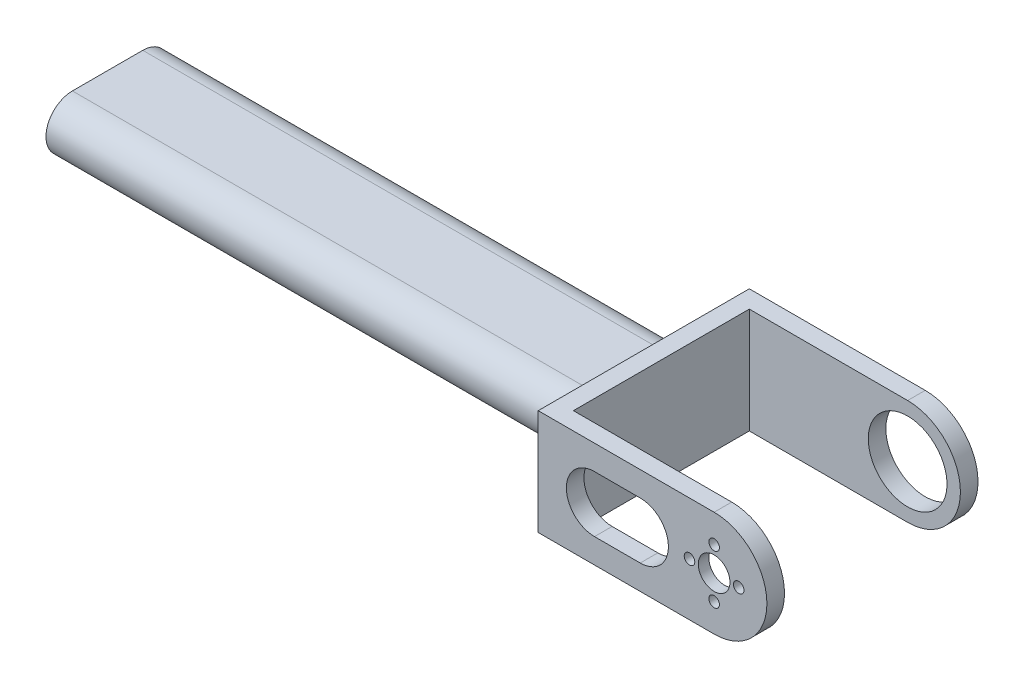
from build123d import *

# Parameters (mm, degrees)
SKETCH1_R           = 4.5
SKETCH1_R_2         = 1.5
BOSS_EXTRUDE1_DEPTH = 5
SKETCH2_W           = 5
SKETCH2_H           = 30
BOSS_EXTRUDE2_DEPTH = 55
SKETCH4_R           = 10.19
CUT_EXTRUDE1_DEPTH  = 2
CUT_EXTRUDE2_REACH  = 81.53
CUT_EXTRUDE5_REACH  = 81.53
SKETCH8_R           = 11.19
BOSS_EXTRUDE3_DEPTH = 152.4
SKETCH10_W          = 8
SKETCH10_H          = 8
CUT_EXTRUDE6_DEPTH  = 10


with BuildPart() as part:
    # Sketch1 → Boss-Extrude1 (new body)
    with BuildSketch(Plane.XY):
        with BuildLine():
            Line((0, 15), (-50, 15))
            Line((-50, 15), (-50, -15))
            Line((-50, -15), (0, -15))
            ThreePointArc((0, -15), (15, 0), (0, 15))
        make_face()
        Circle(SKETCH1_R, mode=Mode.SUBTRACT)
        with Locations((0, 7)):
            Circle(SKETCH1_R_2, mode=Mode.SUBTRACT)
        with Locations((7, 0)):
            Circle(SKETCH1_R_2, mode=Mode.SUBTRACT)
        with Locations((0, -7)):
            Circle(SKETCH1_R_2, mode=Mode.SUBTRACT)
        with Locations((-7, 0)):
            Circle(SKETCH1_R_2, mode=Mode.SUBTRACT)
    boss_extrude1 = extrude(amount=BOSS_EXTRUDE1_DEPTH)

    # Sketch2 → Boss-Extrude2 (add)
    with BuildSketch(Plane(origin=(0, 0, 0), x_dir=(-1, 0, 0), z_dir=(0, 0, -1))):
        with Locations((47.5, 0)):
            Rectangle(SKETCH2_W, SKETCH2_H)
    extrude(amount=BOSS_EXTRUDE2_DEPTH)

    # Mirror1: Boss-Extrude1 across plane
    add(boss_extrude1.mirror(Plane(origin=(0, 0, -25), x_dir=(1, 0, 0), z_dir=(0, 0, -1))))

    # Sketch4 → Cut-Extrude1 (cut)
    with BuildSketch(Plane(origin=(0, 0, 0), x_dir=(-1, 0, 0), z_dir=(0, 0, -1))):
        Circle(SKETCH4_R)
    extrude(amount=-CUT_EXTRUDE1_DEPTH, mode=Mode.SUBTRACT)

    # Sketch5 → Cut-Extrude2 (cut, up to next)
    with BuildSketch(Plane.XY.offset(5), mode=Mode.PRIVATE) as cut_extrude2_sk1:
        with BuildLine():
            Line((-34, 8), (-21, 8))
            ThreePointArc((-21, 8), (-13, 0), (-21, -8))
            Line((-21, -8), (-34, -8))
            ThreePointArc((-34, -8), (-42, 0), (-34, 8))
        make_face()
    cut_extrude2_tool1 = extrude(cut_extrude2_sk1.sketch, amount=-CUT_EXTRUDE2_REACH, mode=Mode.PRIVATE) & part.part
    add(cut_extrude2_tool1.solids().sort_by_distance((-27.5, 0, 5))[0], mode=Mode.SUBTRACT)

    # Sketch8 → Cut-Extrude5 (cut, up to next)
    with BuildSketch(Plane(origin=(0, 0, -55), x_dir=(-1, 0, 0), z_dir=(0, 0, -1)), mode=Mode.PRIVATE) as cut_extrude5_sk1:
        Circle(SKETCH8_R)
    cut_extrude5_tool1 = extrude(cut_extrude5_sk1.sketch, amount=-CUT_EXTRUDE5_REACH, mode=Mode.PRIVATE) & part.part
    add(cut_extrude5_tool1.solids().sort_by_distance((0, 0, -55))[0], mode=Mode.SUBTRACT)

    # Sketch9 → Boss-Extrude3 (add)
    with BuildSketch(Plane.ZY.offset(50)):
        with BuildLine():
            Line((-35, 7.5), (-15, 7.5))
            ThreePointArc((-15, 7.5), (-7.5, 0), (-15, -7.5))
            Line((-15, -7.5), (-35, -7.5))
            ThreePointArc((-35, -7.5), (-42.5, 0), (-35, 7.5))
        make_face()
    extrude(amount=BOSS_EXTRUDE3_DEPTH)

    # Sketch10 → Cut-Extrude6 (cut)
    with BuildSketch(Plane.ZY.offset(202.4)):
        with Locations((-25, 0)):
            Rectangle(SKETCH10_W, SKETCH10_H)
    extrude(amount=-CUT_EXTRUDE6_DEPTH, mode=Mode.SUBTRACT)


solid = part.part
